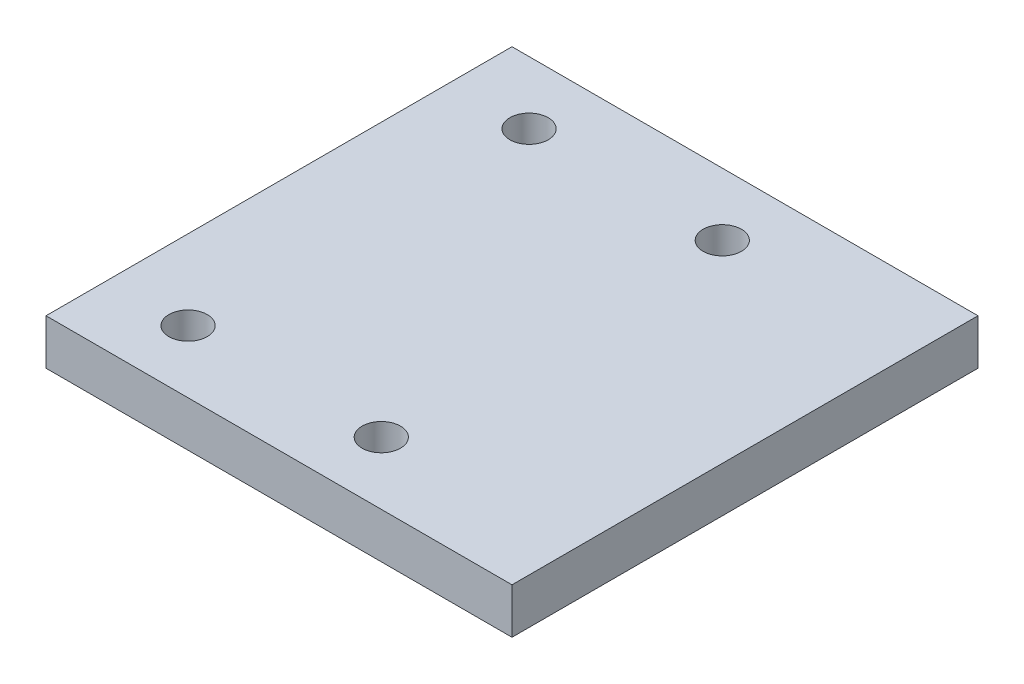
from build123d import *

# Parameters (mm, degrees)
ESQUISSE1_W             = 82
ESQUISSE1_H             = 8
EXTRUSION1_DEPTH        = 41
ESQUISSE2_R             = 3.375
ENL_V_MAT_EXTRU_1_DEPTH = 59.532042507


with BuildPart() as part:
    # Esquisse1 → Extrusion1 (new, symmetric)
    with BuildSketch(Plane.XY):
        with Locations((0, 4)):
            Rectangle(ESQUISSE1_W, ESQUISSE1_H)
    extrude(amount=EXTRUSION1_DEPTH, both=True)

    # Esquisse2 → Enl_v. mat.-Extru.1 (cut, through all)
    with BuildSketch(Plane(origin=(0, 8, 0), x_dir=(1, 0, 0), z_dir=(0, 1, 0))):
        with Locations(Location((-27, 30, 0), (0, 0, 270))):
            Circle(ESQUISSE2_R)
        with Locations(Location((7, 30, 0), (0, 0, 90))):
            Circle(ESQUISSE2_R)
        with Locations(Location((7, -30, 0), (0, 0, 270))):
            Circle(ESQUISSE2_R)
        with Locations(Location((-27, -30, 0), (0, 0, 90))):
            Circle(ESQUISSE2_R)
    extrude(amount=-ENL_V_MAT_EXTRU_1_DEPTH, mode=Mode.SUBTRACT)


solid = part.part
